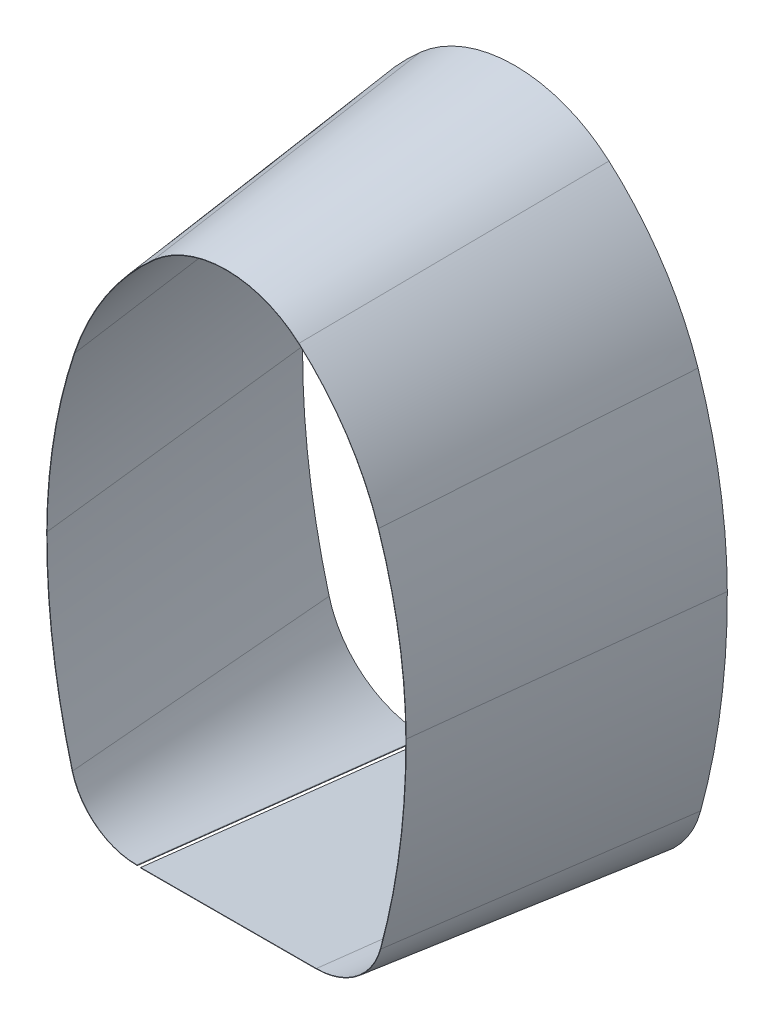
ISO-10303-21;
HEADER;
FILE_DESCRIPTION(('STEP AP214'),'2;1');
FILE_NAME('part.step','',(''),(''),'','','');
FILE_SCHEMA(('AUTOMOTIVE_DESIGN { 1 0 10303 214 1 1 1 1 }'));
ENDSEC;
DATA;
#1=APPLICATION_CONTEXT('core data for automotive mechanical design processes');
#2=APPLICATION_PROTOCOL_DEFINITION('international standard','automotive_design',2000,#1);
#3=PRODUCT_CONTEXT('',#1,'mechanical');
#4=PRODUCT('Part','Part','',(#3));
#5=PRODUCT_RELATED_PRODUCT_CATEGORY('part','',(#4));
#6=PRODUCT_DEFINITION_FORMATION('','',#4);
#7=PRODUCT_DEFINITION_CONTEXT('part definition',#1,'design');
#8=PRODUCT_DEFINITION('design','',#6,#7);
#9=PRODUCT_DEFINITION_SHAPE('','',#8);
#10=(LENGTH_UNIT() NAMED_UNIT(*) SI_UNIT(.MILLI.,.METRE.));
#11=(NAMED_UNIT(*) PLANE_ANGLE_UNIT() SI_UNIT($,.RADIAN.));
#12=(NAMED_UNIT(*) SI_UNIT($,.STERADIAN.) SOLID_ANGLE_UNIT());
#13=UNCERTAINTY_MEASURE_WITH_UNIT(LENGTH_MEASURE(1.E-05),#10,'distance_accuracy_value','');
#14=(GEOMETRIC_REPRESENTATION_CONTEXT(3) GLOBAL_UNCERTAINTY_ASSIGNED_CONTEXT((#13)) GLOBAL_UNIT_ASSIGNED_CONTEXT((#10,
#11,#12)) REPRESENTATION_CONTEXT('',''));
#15=CARTESIAN_POINT('',(0.,0.,0.));
#16=DIRECTION('',(0.,0.,1.));
#17=DIRECTION('',(1.,0.,0.));
#18=AXIS2_PLACEMENT_3D('',#15,#16,#17);
#19=CARTESIAN_POINT('',(-13.1202957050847,-42.3794226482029,-41.1240850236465));
#20=DIRECTION('',(-0.000243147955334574,0.113202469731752,0.993571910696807));
#21=DIRECTION('',(0.999997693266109,0.00214789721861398,1.25385872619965E-10));
#22=AXIS2_PLACEMENT_3D('',#19,#20,#21);
#23=PLANE('',#22);
#24=DIRECTION('',(0.00213409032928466,-0.993569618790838,0.113202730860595));
#25=VECTOR('',#24,1.);
#26=CARTESIAN_POINT('',(-13.1202957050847,-42.3794226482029,-41.1240850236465));
#27=LINE('',#26,#25);
#28=CARTESIAN_POINT('',(-13.1202957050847,-42.3794226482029,-41.1240850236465));
#29=VERTEX_POINT('',#28);
#30=CARTESIAN_POINT('',(-13.1201740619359,-42.436056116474,-41.1176324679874));
#31=VERTEX_POINT('',#30);
#32=EDGE_CURVE('E12',#29,#31,#27,.T.);
#33=ORIENTED_EDGE('',*,*,#32,.F.);
#34=DIRECTION('',(0.999997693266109,0.00214789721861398,1.25385872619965E-10));
#35=VECTOR('',#34,1.);
#36=CARTESIAN_POINT('',(-13.1202957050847,-42.3794226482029,-41.1240850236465));
#37=LINE('',#36,#35);
#38=CARTESIAN_POINT('',(13.7603710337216,-42.3216856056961,-41.124085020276));
#39=VERTEX_POINT('',#38);
#40=EDGE_CURVE('E317',#29,#39,#37,.T.);
#41=ORIENTED_EDGE('',*,*,#40,.T.);
#42=DIRECTION('',(0.00213409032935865,-0.993569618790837,0.113202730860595));
#43=VECTOR('',#42,1.);
#44=CARTESIAN_POINT('',(13.7603710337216,-42.3216856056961,-41.124085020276));
#45=LINE('',#44,#43);
#46=CARTESIAN_POINT('',(13.7604926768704,-42.3783190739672,-41.1176324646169));
#47=VERTEX_POINT('',#46);
#48=EDGE_CURVE('E96',#39,#47,#45,.T.);
#49=ORIENTED_EDGE('',*,*,#48,.T.);
#50=DIRECTION('',(0.999997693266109,0.00214789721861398,1.25385872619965E-10));
#51=VECTOR('',#50,1.);
#52=CARTESIAN_POINT('',(-13.1201740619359,-42.436056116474,-41.1176324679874));
#53=LINE('',#52,#51);
#54=EDGE_CURVE('E315',#31,#47,#53,.T.);
#55=ORIENTED_EDGE('',*,*,#54,.F.);
#56=EDGE_LOOP('',(#33,#41,#49,#55));
#57=FACE_BOUND('',#56,.T.);
#58=ADVANCED_FACE('F86',(#57),#23,.F.);
#59=CARTESIAN_POINT('',(13.7277445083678,-27.1317361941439,-41.124085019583));
#60=DIRECTION('',(-1.25287458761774E-10,-4.5891455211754E-11,1.));
#61=DIRECTION('',(1.,0.,1.25287458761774E-10));
#62=AXIS2_PLACEMENT_3D('',#59,#60,#61);
#63=CONICAL_SURFACE('',#62,15.1899844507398,1.45735041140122);
#64=ORIENTED_EDGE('',*,*,#48,.F.);
#65=CARTESIAN_POINT('',(13.7277445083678,-27.1317361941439,-41.124085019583));
#66=DIRECTION('',(-1.25287458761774E-10,-4.5891455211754E-11,1.));
#67=DIRECTION('',(1.,0.,1.25287458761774E-10));
#68=AXIS2_PLACEMENT_3D('',#65,#66,#67);
#69=CIRCLE('',#68,15.1899844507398);
#70=CARTESIAN_POINT('',(28.3914182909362,-31.0956104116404,-41.1240850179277));
#71=VERTEX_POINT('',#70);
#72=EDGE_CURVE('E441',#39,#71,#69,.T.);
#73=ORIENTED_EDGE('',*,*,#72,.T.);
#74=DIRECTION('',(0.959146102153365,-0.259275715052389,0.113202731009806));
#75=VECTOR('',#74,1.);
#76=CARTESIAN_POINT('',(28.3914182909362,-31.0956104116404,-41.1240850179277));
#77=LINE('',#76,#75);
#78=CARTESIAN_POINT('',(28.4460896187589,-31.1103891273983,-41.1176324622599));
#79=VERTEX_POINT('',#78);
#80=EDGE_CURVE('E308',#71,#79,#77,.T.);
#81=ORIENTED_EDGE('',*,*,#80,.T.);
#82=CARTESIAN_POINT('',(13.727744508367,-27.1317361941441,-41.1176324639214));
#83=DIRECTION('',(1.25287458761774E-10,4.5891455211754E-11,-1.));
#84=DIRECTION('',(-1.,0.,-1.25287458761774E-10));
#85=AXIS2_PLACEMENT_3D('',#82,#83,#84);
#86=CIRCLE('',#85,15.2466180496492);
#87=EDGE_CURVE('E322',#47,#79,#86,.F.);
#88=ORIENTED_EDGE('',*,*,#87,.F.);
#89=EDGE_LOOP('',(#64,#73,#81,#88));
#90=FACE_BOUND('',#89,.T.);
#91=ADVANCED_FACE('F323',(#90),#63,.T.);
#92=CARTESIAN_POINT('',(-84.9013158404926,-0.470396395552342,-41.1240850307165));
#93=DIRECTION('',(-1.25287458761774E-10,-4.5891455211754E-11,1.));
#94=DIRECTION('',(1.,0.,1.25287458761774E-10));
#95=AXIS2_PLACEMENT_3D('',#92,#93,#94);
#96=CONICAL_SURFACE('',#95,117.359053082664,1.45735041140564);
#97=ORIENTED_EDGE('',*,*,#80,.F.);
#98=CARTESIAN_POINT('',(-84.9013158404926,-0.470396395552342,-41.1240850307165));
#99=DIRECTION('',(-1.25287458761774E-10,-4.5891455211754E-11,1.));
#100=DIRECTION('',(1.,0.,1.25287458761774E-10));
#101=AXIS2_PLACEMENT_3D('',#98,#99,#100);
#102=CIRCLE('',#101,117.359053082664);
#103=CARTESIAN_POINT('',(32.4568866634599,-0.0235793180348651,-41.1240850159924));
#104=VERTEX_POINT('',#103);
#105=EDGE_CURVE('E449',#71,#104,#102,.T.);
#106=ORIENTED_EDGE('',*,*,#105,.T.);
#107=DIRECTION('',(0.993564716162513,0.00378106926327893,0.113202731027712));
#108=VECTOR('',#107,1.);
#109=CARTESIAN_POINT('',(32.4568866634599,-0.0235793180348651,-41.1240850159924));
#110=LINE('',#109,#108);
#111=CARTESIAN_POINT('',(32.5135198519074,-0.0233636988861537,-41.1176324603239));
#112=VERTEX_POINT('',#111);
#113=EDGE_CURVE('E306',#104,#112,#110,.T.);
#114=ORIENTED_EDGE('',*,*,#113,.T.);
#115=CARTESIAN_POINT('',(-84.9013158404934,-0.470396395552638,-41.1176324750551));
#116=DIRECTION('',(1.25287458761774E-10,4.5891455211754E-11,-1.));
#117=DIRECTION('',(-1.,0.,-1.25287458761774E-10));
#118=AXIS2_PLACEMENT_3D('',#115,#116,#117);
#119=CIRCLE('',#118,117.415686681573);
#120=EDGE_CURVE('E352',#79,#112,#119,.F.);
#121=ORIENTED_EDGE('',*,*,#120,.F.);
#122=EDGE_LOOP('',(#97,#106,#114,#121));
#123=FACE_BOUND('',#122,.T.);
#124=ADVANCED_FACE('F567',(#123),#96,.T.);
#125=CARTESIAN_POINT('',(-55.3216154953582,-0.357625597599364,-41.1240850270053));
#126=DIRECTION('',(-1.25287458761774E-10,-4.5891455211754E-11,1.));
#127=DIRECTION('',(1.,0.,1.25287458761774E-10));
#128=AXIS2_PLACEMENT_3D('',#125,#126,#127);
#129=CONICAL_SURFACE('',#128,87.7791377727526,1.45735041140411);
#130=ORIENTED_EDGE('',*,*,#113,.F.);
#131=CARTESIAN_POINT('',(-55.3216154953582,-0.357625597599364,-41.1240850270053));
#132=DIRECTION('',(-1.25287458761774E-10,-4.5891455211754E-11,1.));
#133=DIRECTION('',(1.,0.,1.25287458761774E-10));
#134=AXIS2_PLACEMENT_3D('',#131,#132,#133);
#135=CIRCLE('',#134,87.7791377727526);
#136=CARTESIAN_POINT('',(27.9821235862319,27.3130101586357,-41.1240850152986));
#137=VERTEX_POINT('',#136);
#138=EDGE_CURVE('E458',#104,#137,#135,.T.);
#139=ORIENTED_EDGE('',*,*,#138,.T.);
#140=DIRECTION('',(0.94291488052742,0.313203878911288,0.113202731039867));
#141=VECTOR('',#140,1.);
#142=CARTESIAN_POINT('',(27.9821235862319,27.3130101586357,-41.1240850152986));
#143=LINE('',#142,#141);
#144=CARTESIAN_POINT('',(28.035869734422,27.3308627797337,-41.1176324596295));
#145=VERTEX_POINT('',#144);
#146=EDGE_CURVE('E304',#137,#145,#143,.T.);
#147=ORIENTED_EDGE('',*,*,#146,.T.);
#148=CARTESIAN_POINT('',(-55.321615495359,-0.35762559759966,-41.1176324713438));
#149=DIRECTION('',(1.25287458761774E-10,4.5891455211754E-11,-1.));
#150=DIRECTION('',(-1.,0.,-1.25287458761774E-10));
#151=AXIS2_PLACEMENT_3D('',#148,#149,#150);
#152=CIRCLE('',#151,87.835771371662);
#153=EDGE_CURVE('E357',#112,#145,#152,.F.);
#154=ORIENTED_EDGE('',*,*,#153,.F.);
#155=EDGE_LOOP('',(#130,#139,#147,#154));
#156=FACE_BOUND('',#155,.T.);
#157=ADVANCED_FACE('F560',(#156),#129,.T.);
#158=CARTESIAN_POINT('',(-17.0570731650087,12.3525387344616,-41.124085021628));
#159=DIRECTION('',(-1.25287458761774E-10,-4.5891455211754E-11,1.));
#160=DIRECTION('',(1.,0.,1.25287458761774E-10));
#161=AXIS2_PLACEMENT_3D('',#158,#159,#160);
#162=CONICAL_SURFACE('',#161,47.4588764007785,1.45735041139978);
#163=ORIENTED_EDGE('',*,*,#146,.F.);
#164=CARTESIAN_POINT('',(-17.0570731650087,12.3525387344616,-41.124085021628));
#165=DIRECTION('',(-1.25287458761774E-10,-4.5891455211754E-11,1.));
#166=DIRECTION('',(1.,0.,1.25287458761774E-10));
#167=AXIS2_PLACEMENT_3D('',#164,#165,#166);
#168=CIRCLE('',#167,47.4588764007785);
#169=CARTESIAN_POINT('',(14.3800135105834,47.9060832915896,-41.1240850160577));
#170=VERTEX_POINT('',#169);
#171=EDGE_CURVE('E467',#137,#170,#168,.T.);
#172=ORIENTED_EDGE('',*,*,#171,.T.);
#173=DIRECTION('',(0.658148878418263,0.744328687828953,0.113202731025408));
#174=VECTOR('',#173,1.);
#175=CARTESIAN_POINT('',(14.3800135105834,47.9060832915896,-41.1240850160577));
#176=LINE('',#175,#174);
#177=CARTESIAN_POINT('',(14.4175279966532,47.9485100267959,-41.1176324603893));
#178=VERTEX_POINT('',#177);
#179=EDGE_CURVE('E302',#170,#178,#176,.T.);
#180=ORIENTED_EDGE('',*,*,#179,.T.);
#181=CARTESIAN_POINT('',(-17.0570731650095,12.3525387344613,-41.1176324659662));
#182=DIRECTION('',(1.25287458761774E-10,4.5891455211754E-11,-1.));
#183=DIRECTION('',(-1.,0.,-1.25287458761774E-10));
#184=AXIS2_PLACEMENT_3D('',#181,#182,#183);
#185=CIRCLE('',#184,47.5155099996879);
#186=EDGE_CURVE('E362',#145,#178,#185,.F.);
#187=ORIENTED_EDGE('',*,*,#186,.F.);
#188=EDGE_LOOP('',(#163,#172,#180,#187));
#189=FACE_BOUND('',#188,.T.);
#190=ADVANCED_FACE('F553',(#189),#162,.T.);
#191=CARTESIAN_POINT('',(5.15233384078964E-09,31.6431115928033,-41.1240850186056));
#192=DIRECTION('',(-1.25287458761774E-10,-4.5891455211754E-11,1.));
#193=DIRECTION('',(1.,0.,1.25287458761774E-10));
#194=AXIS2_PLACEMENT_3D('',#191,#192,#193);
#195=CONICAL_SURFACE('',#194,21.7087318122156,1.45735041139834);
#196=ORIENTED_EDGE('',*,*,#179,.F.);
#197=CARTESIAN_POINT('',(5.15233384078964E-09,31.6431115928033,-41.1240850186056));
#198=DIRECTION('',(-1.25287458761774E-10,-4.5891455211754E-11,1.));
#199=DIRECTION('',(1.,0.,1.25287458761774E-10));
#200=AXIS2_PLACEMENT_3D('',#197,#198,#199);
#201=CIRCLE('',#200,21.7087318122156);
#202=CARTESIAN_POINT('',(-14.3800135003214,47.9060832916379,-41.124085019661));
#203=VERTEX_POINT('',#202);
#204=EDGE_CURVE('E476',#170,#203,#201,.T.);
#205=ORIENTED_EDGE('',*,*,#204,.T.);
#206=DIRECTION('',(-0.658148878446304,0.744328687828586,0.113202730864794));
#207=VECTOR('',#206,1.);
#208=CARTESIAN_POINT('',(-14.3800135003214,47.9060832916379,-41.124085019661));
#209=LINE('',#208,#207);
#210=CARTESIAN_POINT('',(-14.4175279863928,47.9485100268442,-41.1176324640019));
#211=VERTEX_POINT('',#210);
#212=EDGE_CURVE('E300',#203,#211,#209,.T.);
#213=ORIENTED_EDGE('',*,*,#212,.T.);
#214=CARTESIAN_POINT('',(5.15152541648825E-09,31.643111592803,-41.1176324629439));
#215=DIRECTION('',(1.25287458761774E-10,4.5891455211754E-11,-1.));
#216=DIRECTION('',(-1.,0.,-1.25287458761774E-10));
#217=AXIS2_PLACEMENT_3D('',#214,#215,#216);
#218=CIRCLE('',#217,21.765365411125);
#219=EDGE_CURVE('E367',#178,#211,#218,.F.);
#220=ORIENTED_EDGE('',*,*,#219,.F.);
#221=EDGE_LOOP('',(#196,#205,#213,#220));
#222=FACE_BOUND('',#221,.T.);
#223=ADVANCED_FACE('F546',(#222),#195,.T.);
#224=CARTESIAN_POINT('',(17.0570731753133,12.3525387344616,-41.1240850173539));
#225=DIRECTION('',(-1.25287458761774E-10,-4.5891455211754E-11,1.));
#226=DIRECTION('',(1.,0.,1.25287458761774E-10));
#227=AXIS2_PLACEMENT_3D('',#224,#225,#226);
#228=CONICAL_SURFACE('',#227,47.4588764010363,1.45735041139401);
#229=ORIENTED_EDGE('',*,*,#212,.F.);
#230=CARTESIAN_POINT('',(17.0570731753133,12.3525387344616,-41.1240850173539));
#231=DIRECTION('',(-1.25287458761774E-10,-4.5891455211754E-11,1.));
#232=DIRECTION('',(1.,0.,1.25287458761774E-10));
#233=AXIS2_PLACEMENT_3D('',#230,#231,#232);
#234=CIRCLE('',#233,47.4588764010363);
#235=CARTESIAN_POINT('',(-27.9821235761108,27.3130101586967,-41.1240850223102));
#236=VERTEX_POINT('',#235);
#237=EDGE_CURVE('E485',#203,#236,#234,.T.);
#238=ORIENTED_EDGE('',*,*,#237,.T.);
#239=DIRECTION('',(-0.94291488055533,0.313203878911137,0.113202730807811));
#240=VECTOR('',#239,1.);
#241=CARTESIAN_POINT('',(-27.9821235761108,27.3130101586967,-41.1240850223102));
#242=LINE('',#241,#240);
#243=CARTESIAN_POINT('',(-28.0358697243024,27.3308627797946,-41.117632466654));
#244=VERTEX_POINT('',#243);
#245=EDGE_CURVE('E298',#236,#244,#242,.T.);
#246=ORIENTED_EDGE('',*,*,#245,.T.);
#247=CARTESIAN_POINT('',(17.0570731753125,12.3525387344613,-41.1176324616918));
#248=DIRECTION('',(1.25287458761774E-10,4.5891455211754E-11,-1.));
#249=DIRECTION('',(-1.,0.,-1.25287458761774E-10));
#250=AXIS2_PLACEMENT_3D('',#247,#248,#249);
#251=CIRCLE('',#250,47.5155099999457);
#252=EDGE_CURVE('E372',#211,#244,#251,.F.);
#253=ORIENTED_EDGE('',*,*,#252,.F.);
#254=EDGE_LOOP('',(#229,#238,#246,#253));
#255=FACE_BOUND('',#254,.T.);
#256=ADVANCED_FACE('F539',(#255),#228,.T.);
#257=CARTESIAN_POINT('',(55.3216155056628,-0.357625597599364,-41.1240850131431));
#258=DIRECTION('',(-1.25287458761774E-10,-4.5891455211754E-11,1.));
#259=DIRECTION('',(1.,0.,1.25287458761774E-10));
#260=AXIS2_PLACEMENT_3D('',#257,#258,#259);
#261=CONICAL_SURFACE('',#260,87.7791377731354,1.45735041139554);
#262=ORIENTED_EDGE('',*,*,#245,.F.);
#263=CARTESIAN_POINT('',(55.3216155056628,-0.357625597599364,-41.1240850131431));
#264=DIRECTION('',(-1.25287458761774E-10,-4.5891455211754E-11,1.));
#265=DIRECTION('',(1.,0.,1.25287458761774E-10));
#266=AXIS2_PLACEMENT_3D('',#263,#264,#265);
#267=CIRCLE('',#266,87.7791377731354);
#268=CARTESIAN_POINT('',(-32.4568866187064,-0.0235702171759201,-41.1240850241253));
#269=VERTEX_POINT('',#268);
#270=EDGE_CURVE('E494',#236,#269,#267,.T.);
#271=ORIENTED_EDGE('',*,*,#270,.T.);
#272=DIRECTION('',(-0.993564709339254,0.00378286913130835,0.11320273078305));
#273=VECTOR('',#272,1.);
#274=CARTESIAN_POINT('',(-32.4568866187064,-0.0235702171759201,-41.1240850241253));
#275=LINE('',#274,#273);
#276=CARTESIAN_POINT('',(-32.5135198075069,-0.0233546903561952,-41.1176324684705));
#277=VERTEX_POINT('',#276);
#278=EDGE_CURVE('E296',#269,#277,#275,.T.);
#279=ORIENTED_EDGE('',*,*,#278,.T.);
#280=CARTESIAN_POINT('',(55.321615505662,-0.35762559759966,-41.1176324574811));
#281=DIRECTION('',(1.25287458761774E-10,4.5891455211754E-11,-1.));
#282=DIRECTION('',(-1.,0.,-1.25287458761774E-10));
#283=AXIS2_PLACEMENT_3D('',#280,#281,#282);
#284=CIRCLE('',#283,87.8357713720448);
#285=EDGE_CURVE('E377',#244,#277,#284,.F.);
#286=ORIENTED_EDGE('',*,*,#285,.F.);
#287=EDGE_LOOP('',(#262,#271,#279,#286));
#288=FACE_BOUND('',#287,.T.);
#289=ADVANCED_FACE('F532',(#288),#261,.T.);
#290=CARTESIAN_POINT('',(84.9013158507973,-0.470396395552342,-41.1240850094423));
#291=DIRECTION('',(-1.25287458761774E-10,-4.5891455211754E-11,1.));
#292=DIRECTION('',(1.,0.,1.25287458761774E-10));
#293=AXIS2_PLACEMENT_3D('',#290,#291,#292);
#294=CONICAL_SURFACE('',#293,117.359053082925,1.45735041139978);
#295=ORIENTED_EDGE('',*,*,#278,.F.);
#296=CARTESIAN_POINT('',(84.9013158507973,-0.470396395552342,-41.1240850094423));
#297=DIRECTION('',(-1.25287458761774E-10,-4.5891455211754E-11,1.));
#298=DIRECTION('',(1.,0.,1.25287458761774E-10));
#299=AXIS2_PLACEMENT_3D('',#296,#297,#298);
#300=CIRCLE('',#299,117.359053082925);
#301=CARTESIAN_POINT('',(-28.3914182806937,-31.0956104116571,-41.1240850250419));
#302=VERTEX_POINT('',#301);
#303=EDGE_CURVE('E503',#269,#302,#300,.T.);
#304=ORIENTED_EDGE('',*,*,#303,.T.);
#305=DIRECTION('',(-0.959146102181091,-0.259275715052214,0.11320273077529));
#306=VECTOR('',#305,1.);
#307=CARTESIAN_POINT('',(-28.3914182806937,-31.0956104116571,-41.1240850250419));
#308=LINE('',#307,#306);
#309=CARTESIAN_POINT('',(-28.446089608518,-31.1103891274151,-41.1176324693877));
#310=VERTEX_POINT('',#309);
#311=EDGE_CURVE('E294',#302,#310,#308,.T.);
#312=ORIENTED_EDGE('',*,*,#311,.T.);
#313=CARTESIAN_POINT('',(84.9013158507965,-0.470396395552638,-41.1176324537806));
#314=DIRECTION('',(1.25287458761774E-10,4.5891455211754E-11,-1.));
#315=DIRECTION('',(-1.,0.,-1.25287458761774E-10));
#316=AXIS2_PLACEMENT_3D('',#313,#314,#315);
#317=CIRCLE('',#316,117.415686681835);
#318=EDGE_CURVE('E382',#277,#310,#317,.F.);
#319=ORIENTED_EDGE('',*,*,#318,.F.);
#320=EDGE_LOOP('',(#295,#304,#312,#319));
#321=FACE_BOUND('',#320,.T.);
#322=ADVANCED_FACE('F525',(#321),#294,.T.);
#323=CARTESIAN_POINT('',(-13.7277444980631,-27.1317361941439,-41.1240850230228));
#324=DIRECTION('',(-1.25287458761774E-10,-4.5891455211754E-11,1.));
#325=DIRECTION('',(1.,0.,1.25287458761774E-10));
#326=AXIS2_PLACEMENT_3D('',#323,#324,#325);
#327=CONICAL_SURFACE('',#326,15.1899844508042,1.45735041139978);
#328=ORIENTED_EDGE('',*,*,#311,.F.);
#329=CARTESIAN_POINT('',(-13.7277444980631,-27.1317361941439,-41.1240850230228));
#330=DIRECTION('',(-1.25287458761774E-10,-4.5891455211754E-11,1.));
#331=DIRECTION('',(1.,0.,1.25287458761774E-10));
#332=AXIS2_PLACEMENT_3D('',#329,#330,#331);
#333=CIRCLE('',#332,15.1899844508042);
#334=CARTESIAN_POINT('',(-13.7277444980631,-42.3217206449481,-41.1240850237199));
#335=VERTEX_POINT('',#334);
#336=EDGE_CURVE('E510',#302,#335,#333,.T.);
#337=ORIENTED_EDGE('',*,*,#336,.T.);
#338=DIRECTION('',(-1.41827248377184E-11,-0.993571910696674,0.113202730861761));
#339=VECTOR('',#338,1.);
#340=CARTESIAN_POINT('',(-13.7277444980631,-42.3217206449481,-41.1240850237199));
#341=LINE('',#340,#339);
#342=CARTESIAN_POINT('',(-13.7277444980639,-42.3783542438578,-41.1176324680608));
#343=VERTEX_POINT('',#342);
#344=EDGE_CURVE('E292',#335,#343,#341,.T.);
#345=ORIENTED_EDGE('',*,*,#344,.T.);
#346=CARTESIAN_POINT('',(-13.727744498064,-27.1317361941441,-41.1176324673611));
#347=DIRECTION('',(1.25287458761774E-10,4.5891455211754E-11,-1.));
#348=DIRECTION('',(-1.,0.,-1.25287458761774E-10));
#349=AXIS2_PLACEMENT_3D('',#346,#347,#348);
#350=CIRCLE('',#349,15.2466180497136);
#351=EDGE_CURVE('E386',#310,#343,#350,.F.);
#352=ORIENTED_EDGE('',*,*,#351,.F.);
#353=EDGE_LOOP('',(#328,#337,#345,#352));
#354=FACE_BOUND('',#353,.T.);
#355=ADVANCED_FACE('F518',(#354),#327,.T.);
#356=CARTESIAN_POINT('',(-13.7277444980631,-42.3217206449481,-41.1240850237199));
#357=DIRECTION('',(-1.24510878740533E-10,0.113202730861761,0.993571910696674));
#358=DIRECTION('',(1.,0.,1.25316423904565E-10));
#359=AXIS2_PLACEMENT_3D('',#356,#357,#358);
#360=PLANE('',#359);
#361=ORIENTED_EDGE('',*,*,#344,.F.);
#362=DIRECTION('',(1.,0.,1.25316423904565E-10));
#363=VECTOR('',#362,1.);
#364=CARTESIAN_POINT('',(-13.7277444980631,-42.3217206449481,-41.1240850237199));
#365=LINE('',#364,#363);
#366=CARTESIAN_POINT('',(-13.6277444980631,-42.3217206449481,-41.1240850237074));
#367=VERTEX_POINT('',#366);
#368=EDGE_CURVE('E267',#335,#367,#365,.T.);
#369=ORIENTED_EDGE('',*,*,#368,.T.);
#370=DIRECTION('',(-1.41827248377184E-11,-0.993571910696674,0.113202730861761));
#371=VECTOR('',#370,1.);
#372=CARTESIAN_POINT('',(-13.6277444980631,-42.3217206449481,-41.1240850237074));
#373=LINE('',#372,#371);
#374=CARTESIAN_POINT('',(-13.627744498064,-42.3783542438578,-41.1176324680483));
#375=VERTEX_POINT('',#374);
#376=EDGE_CURVE('E243',#367,#375,#373,.T.);
#377=ORIENTED_EDGE('',*,*,#376,.T.);
#378=DIRECTION('',(1.,0.,1.25316423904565E-10));
#379=VECTOR('',#378,1.);
#380=CARTESIAN_POINT('',(-13.7277444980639,-42.3783542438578,-41.1176324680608));
#381=LINE('',#380,#379);
#382=EDGE_CURVE('E387',#343,#375,#381,.T.);
#383=ORIENTED_EDGE('',*,*,#382,.F.);
#384=EDGE_LOOP('',(#361,#369,#377,#383));
#385=FACE_BOUND('',#384,.T.);
#386=ADVANCED_FACE('F514',(#385),#360,.F.);
#387=CARTESIAN_POINT('',(-13.6277444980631,-42.3217206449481,-41.1240850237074));
#388=DIRECTION('',(-1.,0.,-1.25287447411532E-10));
#389=DIRECTION('',(-1.24482106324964E-10,0.113202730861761,0.993571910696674));
#390=AXIS2_PLACEMENT_3D('',#387,#388,#389);
#391=PLANE('',#390);
#392=ORIENTED_EDGE('',*,*,#376,.F.);
#393=DIRECTION('',(-1.24482106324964E-10,0.113202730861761,0.993571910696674));
#394=VECTOR('',#393,1.);
#395=CARTESIAN_POINT('',(-13.6277444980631,-42.3217206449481,-41.1240850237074));
#396=LINE('',#395,#394);
#397=CARTESIAN_POINT('',(-13.6277445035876,-37.2978206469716,2.97030989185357));
#398=VERTEX_POINT('',#397);
#399=EDGE_CURVE('E262',#367,#398,#396,.T.);
#400=ORIENTED_EDGE('',*,*,#399,.T.);
#401=DIRECTION('',(-1.41827248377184E-11,-0.993571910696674,0.113202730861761));
#402=VECTOR('',#401,1.);
#403=CARTESIAN_POINT('',(-13.6277445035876,-37.2978206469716,2.97030989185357));
#404=LINE('',#403,#402);
#405=CARTESIAN_POINT('',(-13.6277445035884,-37.3544542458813,2.97676244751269));
#406=VERTEX_POINT('',#405);
#407=EDGE_CURVE('E249',#398,#406,#404,.T.);
#408=ORIENTED_EDGE('',*,*,#407,.T.);
#409=DIRECTION('',(-1.24482106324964E-10,0.113202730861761,0.993571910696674));
#410=VECTOR('',#409,1.);
#411=CARTESIAN_POINT('',(-13.627744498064,-42.3783542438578,-41.1176324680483));
#412=LINE('',#411,#410);
#413=EDGE_CURVE('E406',#375,#406,#412,.T.);
#414=ORIENTED_EDGE('',*,*,#413,.F.);
#415=EDGE_LOOP('',(#392,#400,#408,#414));
#416=FACE_BOUND('',#415,.T.);
#417=ADVANCED_FACE('F269',(#416),#391,.F.);
#418=CARTESIAN_POINT('',(-13.7277445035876,-37.2978206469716,2.97030989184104));
#419=DIRECTION('',(-1.24480716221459E-10,0.113202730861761,0.993571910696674));
#420=DIRECTION('',(1.,0.,1.25286066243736E-10));
#421=AXIS2_PLACEMENT_3D('',#418,#419,#420);
#422=PLANE('',#421);
#423=ORIENTED_EDGE('',*,*,#407,.F.);
#424=DIRECTION('',(1.,0.,1.25286066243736E-10));
#425=VECTOR('',#424,1.);
#426=CARTESIAN_POINT('',(-13.7277445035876,-37.2978206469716,2.97030989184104));
#427=LINE('',#426,#425);
#428=CARTESIAN_POINT('',(-13.7277445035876,-37.2978206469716,2.97030989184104));
#429=VERTEX_POINT('',#428);
#430=EDGE_CURVE('E252',#429,#398,#427,.T.);
#431=ORIENTED_EDGE('',*,*,#430,.F.);
#432=DIRECTION('',(-1.41822326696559E-11,-0.993571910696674,0.113202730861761));
#433=VECTOR('',#432,1.);
#434=CARTESIAN_POINT('',(-13.7277445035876,-37.2978206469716,2.97030989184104));
#435=LINE('',#434,#433);
#436=CARTESIAN_POINT('',(-13.7277445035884,-37.3544542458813,2.97676244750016));
#437=VERTEX_POINT('',#436);
#438=EDGE_CURVE('E256',#429,#437,#435,.T.);
#439=ORIENTED_EDGE('',*,*,#438,.T.);
#440=DIRECTION('',(1.,0.,1.25286066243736E-10));
#441=VECTOR('',#440,1.);
#442=CARTESIAN_POINT('',(-13.7277445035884,-37.3544542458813,2.97676244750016));
#443=LINE('',#442,#441);
#444=EDGE_CURVE('E254',#437,#406,#443,.T.);
#445=ORIENTED_EDGE('',*,*,#444,.T.);
#446=EDGE_LOOP('',(#423,#431,#439,#445));
#447=FACE_BOUND('',#446,.T.);
#448=ADVANCED_FACE('F251',(#447),#422,.T.);
#449=CARTESIAN_POINT('',(-13.7277445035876,-27.1317361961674,2.97030989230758));
#450=DIRECTION('',(-1.25287458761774E-10,-4.5891455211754E-11,1.));
#451=DIRECTION('',(1.,0.,1.25287458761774E-10));
#452=AXIS2_PLACEMENT_3D('',#449,#450,#451);
#453=CONICAL_SURFACE('',#452,10.1660844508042,1.45735041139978);
#454=ORIENTED_EDGE('',*,*,#438,.F.);
#455=CARTESIAN_POINT('',(-13.7277445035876,-27.1317361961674,2.97030989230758));
#456=DIRECTION('',(-1.25287458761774E-10,-4.5891455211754E-11,1.));
#457=DIRECTION('',(1.,0.,1.25287458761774E-10));
#458=AXIS2_PLACEMENT_3D('',#455,#456,#457);
#459=CIRCLE('',#458,10.1660844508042);
#460=CARTESIAN_POINT('',(-23.541589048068,-29.7846079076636,2.97030989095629));
#461=VERTEX_POINT('',#460);
#462=EDGE_CURVE('E504',#461,#429,#459,.T.);
#463=ORIENTED_EDGE('',*,*,#462,.F.);
#464=DIRECTION('',(-0.959146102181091,-0.259275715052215,0.11320273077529));
#465=VECTOR('',#464,1.);
#466=CARTESIAN_POINT('',(-23.541589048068,-29.7846079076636,2.97030989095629));
#467=LINE('',#466,#465);
#468=CARTESIAN_POINT('',(-23.5962603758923,-29.7993866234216,2.97676244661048));
#469=VERTEX_POINT('',#468);
#470=EDGE_CURVE('E288',#461,#469,#467,.T.);
#471=ORIENTED_EDGE('',*,*,#470,.T.);
#472=CARTESIAN_POINT('',(-13.7277445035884,-27.1317361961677,2.9767624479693));
#473=DIRECTION('',(1.25287458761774E-10,4.5891455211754E-11,-1.));
#474=DIRECTION('',(-1.,0.,-1.25287458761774E-10));
#475=AXIS2_PLACEMENT_3D('',#472,#473,#474);
#476=CIRCLE('',#475,10.2227180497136);
#477=EDGE_CURVE('E383',#469,#437,#476,.F.);
#478=ORIENTED_EDGE('',*,*,#477,.T.);
#479=EDGE_LOOP('',(#454,#463,#471,#478));
#480=FACE_BOUND('',#479,.T.);
#481=ADVANCED_FACE('F604',(#480),#453,.F.);
#482=CARTESIAN_POINT('',(84.9013158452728,-0.470396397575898,2.9703099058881));
#483=DIRECTION('',(-1.25287458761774E-10,-4.5891455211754E-11,1.));
#484=DIRECTION('',(1.,0.,1.25287458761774E-10));
#485=AXIS2_PLACEMENT_3D('',#482,#483,#484);
#486=CONICAL_SURFACE('',#485,112.335153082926,1.45735041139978);
#487=ORIENTED_EDGE('',*,*,#470,.F.);
#488=CARTESIAN_POINT('',(84.9013158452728,-0.470396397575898,2.9703099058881));
#489=DIRECTION('',(-1.25287458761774E-10,-4.5891455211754E-11,1.));
#490=DIRECTION('',(1.,0.,1.25287458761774E-10));
#491=AXIS2_PLACEMENT_3D('',#488,#489,#490);
#492=CIRCLE('',#491,112.335153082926);
#493=CARTESIAN_POINT('',(-27.4330230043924,-0.0426893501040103,2.97030989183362));
#494=VERTEX_POINT('',#493);
#495=EDGE_CURVE('E495',#494,#461,#492,.T.);
#496=ORIENTED_EDGE('',*,*,#495,.F.);
#497=DIRECTION('',(-0.993564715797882,0.00378117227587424,0.113202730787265));
#498=VECTOR('',#497,1.);
#499=CARTESIAN_POINT('',(-27.4330230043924,-0.0426893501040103,2.97030989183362));
#500=LINE('',#499,#498);
#501=CARTESIAN_POINT('',(-27.4896561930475,-0.0424737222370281,2.97676244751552));
#502=VERTEX_POINT('',#501);
#503=EDGE_CURVE('E286',#494,#502,#500,.T.);
#504=ORIENTED_EDGE('',*,*,#503,.T.);
#505=CARTESIAN_POINT('',(84.901315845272,-0.470396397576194,2.9767624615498));
#506=DIRECTION('',(1.25287458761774E-10,4.5891455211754E-11,-1.));
#507=DIRECTION('',(-1.,0.,-1.25287458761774E-10));
#508=AXIS2_PLACEMENT_3D('',#505,#506,#507);
#509=CIRCLE('',#508,112.391786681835);
#510=EDGE_CURVE('E378',#502,#469,#509,.F.);
#511=ORIENTED_EDGE('',*,*,#510,.T.);
#512=EDGE_LOOP('',(#487,#496,#504,#511));
#513=FACE_BOUND('',#512,.T.);
#514=ADVANCED_FACE('F600',(#513),#486,.F.);
#515=CARTESIAN_POINT('',(55.3216155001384,-0.35762559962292,2.97030990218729));
#516=DIRECTION('',(-1.25287458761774E-10,-4.5891455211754E-11,1.));
#517=DIRECTION('',(1.,0.,1.25287458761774E-10));
#518=AXIS2_PLACEMENT_3D('',#515,#516,#517);
#519=CONICAL_SURFACE('',#518,82.7552377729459,1.45735041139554);
#520=ORIENTED_EDGE('',*,*,#503,.F.);
#521=CARTESIAN_POINT('',(55.3216155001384,-0.35762559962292,2.97030990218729));
#522=DIRECTION('',(-1.25287458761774E-10,-4.5891455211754E-11,1.));
#523=DIRECTION('',(1.,0.,1.25287458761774E-10));
#524=AXIS2_PLACEMENT_3D('',#521,#522,#523);
#525=CIRCLE('',#524,82.7552377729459);
#526=CARTESIAN_POINT('',(-23.2143659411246,25.7293251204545,2.97030989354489));
#527=VERTEX_POINT('',#526);
#528=EDGE_CURVE('E486',#527,#494,#525,.T.);
#529=ORIENTED_EDGE('',*,*,#528,.F.);
#530=DIRECTION('',(-0.942914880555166,0.313203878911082,0.113202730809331));
#531=VECTOR('',#530,1.);
#532=CARTESIAN_POINT('',(-23.2143659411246,25.7293251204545,2.97030989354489));
#533=LINE('',#532,#531);
#534=CARTESIAN_POINT('',(-23.2681120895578,25.7471777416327,2.97676244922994));
#535=VERTEX_POINT('',#534);
#536=EDGE_CURVE('E284',#527,#535,#533,.T.);
#537=ORIENTED_EDGE('',*,*,#536,.T.);
#538=CARTESIAN_POINT('',(55.3216155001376,-0.357625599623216,2.97676245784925));
#539=DIRECTION('',(1.25287458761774E-10,4.5891455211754E-11,-1.));
#540=DIRECTION('',(-1.,0.,-1.25287458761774E-10));
#541=AXIS2_PLACEMENT_3D('',#538,#539,#540);
#542=CIRCLE('',#541,82.8118713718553);
#543=EDGE_CURVE('E373',#535,#502,#542,.F.);
#544=ORIENTED_EDGE('',*,*,#543,.T.);
#545=EDGE_LOOP('',(#520,#529,#537,#544));
#546=FACE_BOUND('',#545,.T.);
#547=ADVANCED_FACE('F596',(#546),#519,.F.);
#548=CARTESIAN_POINT('',(17.0570731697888,12.3525387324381,2.97030989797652));
#549=DIRECTION('',(-1.25287458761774E-10,-4.5891455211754E-11,1.));
#550=DIRECTION('',(1.,0.,1.25287458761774E-10));
#551=AXIS2_PLACEMENT_3D('',#548,#549,#550);
#552=CONICAL_SURFACE('',#551,42.4349764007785,1.45735041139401);
#553=ORIENTED_EDGE('',*,*,#536,.F.);
#554=CARTESIAN_POINT('',(17.0570731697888,12.3525387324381,2.97030989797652));
#555=DIRECTION('',(-1.25287458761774E-10,-4.5891455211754E-11,1.));
#556=DIRECTION('',(1.,0.,1.25287458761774E-10));
#557=AXIS2_PLACEMENT_3D('',#554,#555,#556);
#558=CIRCLE('',#557,42.4349764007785);
#559=CARTESIAN_POINT('',(-11.0521475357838,44.1424574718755,2.97030989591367));
#560=VERTEX_POINT('',#559);
#561=EDGE_CURVE('E477',#560,#527,#558,.T.);
#562=ORIENTED_EDGE('',*,*,#561,.F.);
#563=DIRECTION('',(-0.658148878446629,0.744328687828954,0.113202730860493));
#564=VECTOR('',#563,1.);
#565=CARTESIAN_POINT('',(-11.0521475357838,44.1424574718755,2.97030989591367));
#566=LINE('',#565,#564);
#567=CARTESIAN_POINT('',(-11.0896620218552,44.1848842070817,2.97676245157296));
#568=VERTEX_POINT('',#567);
#569=EDGE_CURVE('E282',#560,#568,#566,.T.);
#570=ORIENTED_EDGE('',*,*,#569,.T.);
#571=CARTESIAN_POINT('',(17.057073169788,12.3525387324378,2.97676245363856));
#572=DIRECTION('',(1.25287458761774E-10,4.5891455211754E-11,-1.));
#573=DIRECTION('',(-1.,0.,-1.25287458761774E-10));
#574=AXIS2_PLACEMENT_3D('',#571,#572,#573);
#575=CIRCLE('',#574,42.4916099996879);
#576=EDGE_CURVE('E368',#568,#535,#575,.F.);
#577=ORIENTED_EDGE('',*,*,#576,.T.);
#578=EDGE_LOOP('',(#553,#562,#570,#577));
#579=FACE_BOUND('',#578,.T.);
#580=ADVANCED_FACE('F592',(#579),#552,.F.);
#581=CARTESIAN_POINT('',(-3.72140843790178E-10,31.6431115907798,2.97030989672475));
#582=DIRECTION('',(-1.25287458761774E-10,-4.5891455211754E-11,1.));
#583=DIRECTION('',(1.,0.,1.25287458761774E-10));
#584=AXIS2_PLACEMENT_3D('',#581,#582,#583);
#585=CONICAL_SURFACE('',#584,16.6848318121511,1.45735041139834);
#586=ORIENTED_EDGE('',*,*,#569,.F.);
#587=CARTESIAN_POINT('',(-3.72140843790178E-10,31.6431115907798,2.97030989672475));
#588=DIRECTION('',(-1.25287458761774E-10,-4.5891455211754E-11,1.));
#589=DIRECTION('',(1.,0.,1.25287458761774E-10));
#590=AXIS2_PLACEMENT_3D('',#587,#588,#589);
#591=CIRCLE('',#590,16.6848318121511);
#592=CARTESIAN_POINT('',(11.0521475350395,44.1424574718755,2.97030989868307));
#593=VERTEX_POINT('',#592);
#594=EDGE_CURVE('E468',#593,#560,#591,.T.);
#595=ORIENTED_EDGE('',*,*,#594,.F.);
#596=DIRECTION('',(0.658148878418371,0.744328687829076,0.113202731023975));
#597=VECTOR('',#596,1.);
#598=CARTESIAN_POINT('',(11.0521475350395,44.1424574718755,2.97030989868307));
#599=LINE('',#598,#597);
#600=CARTESIAN_POINT('',(11.0896620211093,44.1848842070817,2.97676245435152));
#601=VERTEX_POINT('',#600);
#602=EDGE_CURVE('E280',#593,#601,#599,.T.);
#603=ORIENTED_EDGE('',*,*,#602,.T.);
#604=CARTESIAN_POINT('',(-3.72949268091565E-10,31.6431115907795,2.97676245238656));
#605=DIRECTION('',(1.25287458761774E-10,4.5891455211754E-11,-1.));
#606=DIRECTION('',(-1.,0.,-1.25287458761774E-10));
#607=AXIS2_PLACEMENT_3D('',#604,#605,#606);
#608=CIRCLE('',#607,16.7414654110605);
#609=EDGE_CURVE('E363',#601,#568,#608,.F.);
#610=ORIENTED_EDGE('',*,*,#609,.T.);
#611=EDGE_LOOP('',(#586,#595,#603,#610));
#612=FACE_BOUND('',#611,.T.);
#613=ADVANCED_FACE('F588',(#612),#585,.F.);
#614=CARTESIAN_POINT('',(-17.0570731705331,12.3525387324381,2.97030989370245));
#615=DIRECTION('',(-1.25287458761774E-10,-4.5891455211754E-11,1.));
#616=DIRECTION('',(1.,0.,1.25287458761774E-10));
#617=AXIS2_PLACEMENT_3D('',#614,#615,#616);
#618=CONICAL_SURFACE('',#617,42.4349764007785,1.45735041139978);
#619=ORIENTED_EDGE('',*,*,#602,.F.);
#620=CARTESIAN_POINT('',(-17.0570731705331,12.3525387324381,2.97030989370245));
#621=DIRECTION('',(-1.25287458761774E-10,-4.5891455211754E-11,1.));
#622=DIRECTION('',(1.,0.,1.25287458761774E-10));
#623=AXIS2_PLACEMENT_3D('',#620,#621,#622);
#624=CIRCLE('',#623,42.4349764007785);
#625=CARTESIAN_POINT('',(23.214365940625,25.7293251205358,2.97030989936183));
#626=VERTEX_POINT('',#625);
#627=EDGE_CURVE('E459',#626,#593,#624,.T.);
#628=ORIENTED_EDGE('',*,*,#627,.F.);
#629=DIRECTION('',(0.942914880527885,0.313203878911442,0.113202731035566));
#630=VECTOR('',#629,1.);
#631=CARTESIAN_POINT('',(23.214365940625,25.7293251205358,2.97030989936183));
#632=LINE('',#631,#630);
#633=CARTESIAN_POINT('',(23.2681120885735,25.7471777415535,2.9767624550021));
#634=VERTEX_POINT('',#633);
#635=EDGE_CURVE('E278',#626,#634,#632,.T.);
#636=ORIENTED_EDGE('',*,*,#635,.T.);
#637=CARTESIAN_POINT('',(-17.0570731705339,12.3525387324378,2.97676244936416));
#638=DIRECTION('',(1.25287458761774E-10,4.5891455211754E-11,-1.));
#639=DIRECTION('',(-1.,0.,-1.25287458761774E-10));
#640=AXIS2_PLACEMENT_3D('',#637,#638,#639);
#641=CIRCLE('',#640,42.4916099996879);
#642=EDGE_CURVE('E358',#634,#601,#641,.F.);
#643=ORIENTED_EDGE('',*,*,#642,.T.);
#644=EDGE_LOOP('',(#619,#628,#636,#643));
#645=FACE_BOUND('',#644,.T.);
#646=ADVANCED_FACE('F584',(#645),#618,.F.);
#647=CARTESIAN_POINT('',(-55.3216155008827,-0.35762559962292,2.97030988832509));
#648=DIRECTION('',(-1.25287458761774E-10,-4.5891455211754E-11,1.));
#649=DIRECTION('',(1.,0.,1.25287458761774E-10));
#650=AXIS2_PLACEMENT_3D('',#647,#648,#649);
#651=CONICAL_SURFACE('',#650,82.7552377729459,1.45735041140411);
#652=ORIENTED_EDGE('',*,*,#635,.F.);
#653=CARTESIAN_POINT('',(-55.3216155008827,-0.35762559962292,2.97030988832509));
#654=DIRECTION('',(-1.25287458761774E-10,-4.5891455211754E-11,1.));
#655=DIRECTION('',(1.,0.,1.25287458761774E-10));
#656=AXIS2_PLACEMENT_3D('',#653,#654,#655);
#657=CIRCLE('',#656,82.7552377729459);
#658=CARTESIAN_POINT('',(27.4330230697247,-0.0427066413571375,2.97030989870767));
#659=VERTEX_POINT('',#658);
#660=EDGE_CURVE('E450',#659,#626,#657,.T.);
#661=ORIENTED_EDGE('',*,*,#660,.F.);
#662=DIRECTION('',(0.993564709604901,0.00378279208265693,0.11320273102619));
#663=VECTOR('',#662,1.);
#664=CARTESIAN_POINT('',(27.4330230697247,-0.0427066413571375,2.97030989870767));
#665=LINE('',#664,#663);
#666=CARTESIAN_POINT('',(27.4896562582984,-0.0424911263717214,2.97676245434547));
#667=VERTEX_POINT('',#666);
#668=EDGE_CURVE('E276',#659,#667,#665,.T.);
#669=ORIENTED_EDGE('',*,*,#668,.T.);
#670=CARTESIAN_POINT('',(-55.3216155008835,-0.357625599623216,2.97676244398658));
#671=DIRECTION('',(1.25287458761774E-10,4.5891455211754E-11,-1.));
#672=DIRECTION('',(-1.,0.,-1.25287458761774E-10));
#673=AXIS2_PLACEMENT_3D('',#670,#671,#672);
#674=CIRCLE('',#673,82.8118713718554);
#675=EDGE_CURVE('E353',#667,#634,#674,.F.);
#676=ORIENTED_EDGE('',*,*,#675,.T.);
#677=EDGE_LOOP('',(#652,#661,#669,#676));
#678=FACE_BOUND('',#677,.T.);
#679=ADVANCED_FACE('F580',(#678),#651,.F.);
#680=CARTESIAN_POINT('',(-84.9013158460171,-0.470396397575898,2.97030988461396));
#681=DIRECTION('',(-1.25287458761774E-10,-4.5891455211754E-11,1.));
#682=DIRECTION('',(1.,0.,1.25287458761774E-10));
#683=AXIS2_PLACEMENT_3D('',#680,#681,#682);
#684=CONICAL_SURFACE('',#683,112.335153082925,1.45735041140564);
#685=ORIENTED_EDGE('',*,*,#668,.F.);
#686=CARTESIAN_POINT('',(-84.9013158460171,-0.470396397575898,2.97030988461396));
#687=DIRECTION('',(-1.25287458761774E-10,-4.5891455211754E-11,1.));
#688=DIRECTION('',(1.,0.,1.25287458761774E-10));
#689=AXIS2_PLACEMENT_3D('',#686,#687,#688);
#690=CIRCLE('',#689,112.335153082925);
#691=CARTESIAN_POINT('',(23.5415890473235,-29.7846079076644,2.97030989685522));
#692=VERTEX_POINT('',#691);
#693=EDGE_CURVE('E442',#692,#659,#690,.T.);
#694=ORIENTED_EDGE('',*,*,#693,.F.);
#695=DIRECTION('',(0.959146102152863,-0.259275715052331,0.113202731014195));
#696=VECTOR('',#695,1.);
#697=CARTESIAN_POINT('',(23.5415890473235,-29.7846079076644,2.97030989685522));
#698=LINE('',#697,#696);
#699=CARTESIAN_POINT('',(23.5962603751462,-29.7993866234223,2.97676245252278));
#700=VERTEX_POINT('',#699);
#701=EDGE_CURVE('E274',#692,#700,#698,.T.);
#702=ORIENTED_EDGE('',*,*,#701,.T.);
#703=CARTESIAN_POINT('',(-84.9013158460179,-0.470396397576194,2.97676244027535));
#704=DIRECTION('',(1.25287458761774E-10,4.5891455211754E-11,-1.));
#705=DIRECTION('',(-1.,0.,-1.25287458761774E-10));
#706=AXIS2_PLACEMENT_3D('',#703,#704,#705);
#707=CIRCLE('',#706,112.391786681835);
#708=EDGE_CURVE('E348',#700,#667,#707,.F.);
#709=ORIENTED_EDGE('',*,*,#708,.T.);
#710=EDGE_LOOP('',(#685,#694,#702,#709));
#711=FACE_BOUND('',#710,.T.);
#712=ADVANCED_FACE('F576',(#711),#684,.F.);
#713=CARTESIAN_POINT('',(13.7277445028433,-27.1317361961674,2.97030989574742));
#714=DIRECTION('',(-1.25287458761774E-10,-4.5891455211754E-11,1.));
#715=DIRECTION('',(1.,0.,1.25287458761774E-10));
#716=AXIS2_PLACEMENT_3D('',#713,#714,#715);
#717=CONICAL_SURFACE('',#716,10.1660844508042,1.45735041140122);
#718=ORIENTED_EDGE('',*,*,#701,.F.);
#719=CARTESIAN_POINT('',(13.7277445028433,-27.1317361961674,2.97030989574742));
#720=DIRECTION('',(-1.25287458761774E-10,-4.5891455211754E-11,1.));
#721=DIRECTION('',(1.,0.,1.25287458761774E-10));
#722=AXIS2_PLACEMENT_3D('',#719,#720,#721);
#723=CIRCLE('',#722,10.1660844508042);
#724=CARTESIAN_POINT('',(13.7495802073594,-37.2977971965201,2.97030989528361));
#725=VERTEX_POINT('',#724);
#726=EDGE_CURVE('E437',#725,#692,#723,.T.);
#727=ORIENTED_EDGE('',*,*,#726,.F.);
#728=DIRECTION('',(0.00213409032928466,-0.993569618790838,0.113202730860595));
#729=VECTOR('',#728,1.);
#730=CARTESIAN_POINT('',(13.7495802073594,-37.2977971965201,2.97030989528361));
#731=LINE('',#730,#729);
#732=CARTESIAN_POINT('',(13.7497018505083,-37.3544306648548,2.97676245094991));
#733=VERTEX_POINT('',#732);
#734=EDGE_CURVE('E104',#725,#733,#731,.T.);
#735=ORIENTED_EDGE('',*,*,#734,.T.);
#736=CARTESIAN_POINT('',(13.7277445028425,-27.1317361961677,2.97676245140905));
#737=DIRECTION('',(1.25287458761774E-10,4.5891455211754E-11,-1.));
#738=DIRECTION('',(-1.,0.,-1.25287458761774E-10));
#739=AXIS2_PLACEMENT_3D('',#736,#737,#738);
#740=CIRCLE('',#739,10.2227180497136);
#741=EDGE_CURVE('E328',#733,#700,#740,.F.);
#742=ORIENTED_EDGE('',*,*,#741,.T.);
#743=EDGE_LOOP('',(#718,#727,#735,#742));
#744=FACE_BOUND('',#743,.T.);
#745=ADVANCED_FACE('F633',(#744),#717,.F.);
#746=CARTESIAN_POINT('',(-13.1310865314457,-37.3555342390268,2.97030989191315));
#747=DIRECTION('',(-0.000243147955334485,0.113202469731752,0.993571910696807));
#748=DIRECTION('',(0.999997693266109,0.00214789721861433,1.25385743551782E-10));
#749=AXIS2_PLACEMENT_3D('',#746,#747,#748);
#750=PLANE('',#749);
#751=ORIENTED_EDGE('',*,*,#734,.F.);
#752=DIRECTION('',(0.999997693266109,0.00214789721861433,1.25385743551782E-10));
#753=VECTOR('',#752,1.);
#754=CARTESIAN_POINT('',(-13.1310865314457,-37.3555342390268,2.97030989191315));
#755=LINE('',#754,#753);
#756=CARTESIAN_POINT('',(-13.1310865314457,-37.3555342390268,2.97030989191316));
#757=VERTEX_POINT('',#756);
#758=EDGE_CURVE('E431',#757,#725,#755,.T.);
#759=ORIENTED_EDGE('',*,*,#758,.F.);
#760=DIRECTION('',(0.00213409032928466,-0.993569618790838,0.113202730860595));
#761=VECTOR('',#760,1.);
#762=CARTESIAN_POINT('',(-13.1310865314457,-37.3555342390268,2.97030989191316));
#763=LINE('',#762,#761);
#764=CARTESIAN_POINT('',(-13.1309648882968,-37.4121677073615,2.97676244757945));
#765=VERTEX_POINT('',#764);
#766=EDGE_CURVE('E90',#757,#765,#763,.T.);
#767=ORIENTED_EDGE('',*,*,#766,.T.);
#768=DIRECTION('',(0.999997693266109,0.00214789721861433,1.25385743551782E-10));
#769=VECTOR('',#768,1.);
#770=CARTESIAN_POINT('',(-13.130964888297,-37.4121677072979,2.9767624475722));
#771=LINE('',#770,#769);
#772=EDGE_CURVE('E342',#765,#733,#771,.T.);
#773=ORIENTED_EDGE('',*,*,#772,.T.);
#774=EDGE_LOOP('',(#751,#759,#767,#773));
#775=FACE_BOUND('',#774,.T.);
#776=ADVANCED_FACE('F635',(#775),#750,.T.);
#777=CARTESIAN_POINT('',(-13.1202957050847,-42.3794226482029,-41.1240850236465));
#778=DIRECTION('',(-0.999997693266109,-0.00214789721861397,-1.2538579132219E-10));
#779=DIRECTION('',(-0.000243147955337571,0.113202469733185,0.993571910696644));
#780=AXIS2_PLACEMENT_3D('',#777,#778,#779);
#781=PLANE('',#780);
#782=DIRECTION('',(-0.000243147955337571,0.113202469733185,0.993571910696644));
#783=VECTOR('',#782,1.);
#784=CARTESIAN_POINT('',(-13.1202957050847,-42.3794226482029,-41.1240850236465));
#785=LINE('',#784,#783);
#786=EDGE_CURVE('E428',#29,#757,#785,.T.);
#787=ORIENTED_EDGE('',*,*,#786,.F.);
#788=ORIENTED_EDGE('',*,*,#32,.T.);
#789=DIRECTION('',(-0.000243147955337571,0.113202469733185,0.993571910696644));
#790=VECTOR('',#789,1.);
#791=CARTESIAN_POINT('',(-13.1201740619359,-42.436056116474,-41.1176324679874));
#792=LINE('',#791,#790);
#793=EDGE_CURVE('E338',#31,#765,#792,.T.);
#794=ORIENTED_EDGE('',*,*,#793,.T.);
#795=ORIENTED_EDGE('',*,*,#766,.F.);
#796=EDGE_LOOP('',(#787,#788,#794,#795));
#797=FACE_BOUND('',#796,.T.);
#798=ADVANCED_FACE('F88',(#797),#781,.T.);
#799=CARTESIAN_POINT('',(13.7604926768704,-42.3783190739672,-41.1176324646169));
#800=DIRECTION('',(-0.00213409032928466,0.993569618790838,-0.113202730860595));
#801=DIRECTION('',(0.,0.113202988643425,0.993571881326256));
#802=AXIS2_PLACEMENT_3D('',#799,#800,#801);
#803=PLANE('',#802);
#804=DIRECTION('',(0.000243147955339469,-0.113202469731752,-0.993571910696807));
#805=VECTOR('',#804,1.);
#806=CARTESIAN_POINT('',(13.7604926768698,-42.3783190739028,-41.1176324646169));
#807=LINE('',#806,#805);
#808=EDGE_CURVE('E336',#47,#733,#807,.F.);
#809=ORIENTED_EDGE('',*,*,#808,.T.);
#810=ORIENTED_EDGE('',*,*,#772,.F.);
#811=ORIENTED_EDGE('',*,*,#793,.F.);
#812=ORIENTED_EDGE('',*,*,#54,.T.);
#813=EDGE_LOOP('',(#809,#810,#811,#812));
#814=FACE_BOUND('',#813,.T.);
#815=ADVANCED_FACE('F334',(#814),#803,.F.);
#816=CARTESIAN_POINT('',(13.727744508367,-27.1317361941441,-41.1176324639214));
#817=DIRECTION('',(1.25287458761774E-10,4.5891455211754E-11,-1.));
#818=DIRECTION('',(-1.,0.,-1.25287458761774E-10));
#819=AXIS2_PLACEMENT_3D('',#816,#817,#818);
#820=CONICAL_SURFACE('',#819,15.2466180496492,0.113445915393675);
#821=DIRECTION('',(0.109280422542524,-0.0295406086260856,-0.993571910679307));
#822=VECTOR('',#821,1.);
#823=CARTESIAN_POINT('',(28.4460896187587,-31.1103891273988,-41.1176324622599));
#824=LINE('',#823,#822);
#825=EDGE_CURVE('E329',#79,#700,#824,.F.);
#826=ORIENTED_EDGE('',*,*,#825,.T.);
#827=ORIENTED_EDGE('',*,*,#741,.F.);
#828=ORIENTED_EDGE('',*,*,#808,.F.);
#829=ORIENTED_EDGE('',*,*,#87,.T.);
#830=EDGE_LOOP('',(#826,#827,#828,#829));
#831=FACE_BOUND('',#830,.T.);
#832=ADVANCED_FACE('F340',(#831),#820,.T.);
#833=CARTESIAN_POINT('',(-84.9013158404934,-0.470396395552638,-41.1176324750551));
#834=DIRECTION('',(1.25287458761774E-10,4.5891455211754E-11,-1.));
#835=DIRECTION('',(-1.,0.,-1.25287458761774E-10));
#836=AXIS2_PLACEMENT_3D('',#833,#834,#835);
#837=CONICAL_SURFACE('',#836,117.415686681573,0.113445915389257);
#838=DIRECTION('',(0.113201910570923,0.000430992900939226,-0.99357191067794));
#839=VECTOR('',#838,1.);
#840=CARTESIAN_POINT('',(32.5135198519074,-0.0233636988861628,-41.1176324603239));
#841=LINE('',#840,#839);
#842=EDGE_CURVE('E349',#112,#667,#841,.F.);
#843=ORIENTED_EDGE('',*,*,#842,.T.);
#844=ORIENTED_EDGE('',*,*,#708,.F.);
#845=ORIENTED_EDGE('',*,*,#825,.F.);
#846=ORIENTED_EDGE('',*,*,#120,.T.);
#847=EDGE_LOOP('',(#843,#844,#845,#846));
#848=FACE_BOUND('',#847,.T.);
#849=ADVANCED_FACE('F631',(#848),#837,.T.);
#850=CARTESIAN_POINT('',(-55.321615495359,-0.35762559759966,-41.1176324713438));
#851=DIRECTION('',(1.25287458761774E-10,4.5891455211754E-11,-1.));
#852=DIRECTION('',(-1.,0.,-1.25287458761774E-10));
#853=AXIS2_PLACEMENT_3D('',#850,#851,#852);
#854=CONICAL_SURFACE('',#853,87.835771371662,0.113445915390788);
#855=DIRECTION('',(0.107431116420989,0.0356849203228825,-0.993571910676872));
#856=VECTOR('',#855,1.);
#857=CARTESIAN_POINT('',(28.035869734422,27.3308627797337,-41.1176324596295));
#858=LINE('',#857,#856);
#859=EDGE_CURVE('E354',#145,#634,#858,.F.);
#860=ORIENTED_EDGE('',*,*,#859,.T.);
#861=ORIENTED_EDGE('',*,*,#675,.F.);
#862=ORIENTED_EDGE('',*,*,#842,.F.);
#863=ORIENTED_EDGE('',*,*,#153,.T.);
#864=EDGE_LOOP('',(#860,#861,#862,#863));
#865=FACE_BOUND('',#864,.T.);
#866=ADVANCED_FACE('F628',(#865),#854,.T.);
#867=CARTESIAN_POINT('',(-17.0570731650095,12.3525387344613,-41.1176324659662));
#868=DIRECTION('',(1.25287458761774E-10,4.5891455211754E-11,-1.));
#869=DIRECTION('',(-1.,0.,-1.25287458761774E-10));
#870=AXIS2_PLACEMENT_3D('',#867,#868,#869);
#871=CONICAL_SURFACE('',#870,47.5155099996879,0.113445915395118);
#872=DIRECTION('',(0.0749862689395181,0.084805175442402,-0.993571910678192));
#873=VECTOR('',#872,1.);
#874=CARTESIAN_POINT('',(14.4175279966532,47.9485100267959,-41.1176324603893));
#875=LINE('',#874,#873);
#876=EDGE_CURVE('E359',#178,#601,#875,.F.);
#877=ORIENTED_EDGE('',*,*,#876,.T.);
#878=ORIENTED_EDGE('',*,*,#642,.F.);
#879=ORIENTED_EDGE('',*,*,#859,.F.);
#880=ORIENTED_EDGE('',*,*,#186,.T.);
#881=EDGE_LOOP('',(#877,#878,#879,#880));
#882=FACE_BOUND('',#881,.T.);
#883=ADVANCED_FACE('F625',(#882),#871,.T.);
#884=CARTESIAN_POINT('',(5.15152541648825E-09,31.643111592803,-41.1176324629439));
#885=DIRECTION('',(1.25287458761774E-10,4.5891455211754E-11,-1.));
#886=DIRECTION('',(-1.,0.,-1.25287458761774E-10));
#887=AXIS2_PLACEMENT_3D('',#884,#885,#886);
#888=CONICAL_SURFACE('',#887,21.765365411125,0.113445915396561);
#889=DIRECTION('',(-0.0749862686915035,0.084805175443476,-0.993571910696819));
#890=VECTOR('',#889,1.);
#891=CARTESIAN_POINT('',(-14.4175279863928,47.9485100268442,-41.1176324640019));
#892=LINE('',#891,#890);
#893=EDGE_CURVE('E364',#211,#568,#892,.F.);
#894=ORIENTED_EDGE('',*,*,#893,.T.);
#895=ORIENTED_EDGE('',*,*,#609,.F.);
#896=ORIENTED_EDGE('',*,*,#876,.F.);
#897=ORIENTED_EDGE('',*,*,#219,.T.);
#898=EDGE_LOOP('',(#894,#895,#896,#897));
#899=FACE_BOUND('',#898,.T.);
#900=ADVANCED_FACE('F622',(#899),#888,.T.);
#901=CARTESIAN_POINT('',(17.0570731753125,12.3525387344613,-41.1176324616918));
#902=DIRECTION('',(1.25287458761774E-10,4.5891455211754E-11,-1.));
#903=DIRECTION('',(-1.,0.,-1.25287458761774E-10));
#904=AXIS2_PLACEMENT_3D('',#901,#902,#903);
#905=CONICAL_SURFACE('',#904,47.5155099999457,0.11344591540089);
#906=DIRECTION('',(-0.10743111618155,0.0356849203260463,-0.993571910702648));
#907=VECTOR('',#906,1.);
#908=CARTESIAN_POINT('',(-28.0358697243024,27.3308627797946,-41.117632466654));
#909=LINE('',#908,#907);
#910=EDGE_CURVE('E369',#244,#535,#909,.F.);
#911=ORIENTED_EDGE('',*,*,#910,.T.);
#912=ORIENTED_EDGE('',*,*,#576,.F.);
#913=ORIENTED_EDGE('',*,*,#893,.F.);
#914=ORIENTED_EDGE('',*,*,#252,.T.);
#915=EDGE_LOOP('',(#911,#912,#913,#914));
#916=FACE_BOUND('',#915,.T.);
#917=ADVANCED_FACE('F619',(#916),#905,.T.);
#918=CARTESIAN_POINT('',(55.321615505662,-0.35762559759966,-41.1176324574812));
#919=DIRECTION('',(1.25287458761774E-10,4.5891455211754E-11,-1.));
#920=DIRECTION('',(-1.,0.,-1.25287458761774E-10));
#921=AXIS2_PLACEMENT_3D('',#918,#919,#920);
#922=CONICAL_SURFACE('',#921,87.8357713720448,0.113445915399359);
#923=DIRECTION('',(-0.113201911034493,0.000430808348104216,-0.993571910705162));
#924=VECTOR('',#923,1.);
#925=CARTESIAN_POINT('',(-32.5135198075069,-0.0233546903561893,-41.1176324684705));
#926=LINE('',#925,#924);
#927=EDGE_CURVE('E374',#277,#502,#926,.F.);
#928=ORIENTED_EDGE('',*,*,#927,.T.);
#929=ORIENTED_EDGE('',*,*,#543,.F.);
#930=ORIENTED_EDGE('',*,*,#910,.F.);
#931=ORIENTED_EDGE('',*,*,#285,.T.);
#932=EDGE_LOOP('',(#928,#929,#930,#931));
#933=FACE_BOUND('',#932,.T.);
#934=ADVANCED_FACE('F616',(#933),#922,.T.);
#935=CARTESIAN_POINT('',(84.9013158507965,-0.470396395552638,-41.1176324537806));
#936=DIRECTION('',(1.25287458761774E-10,4.5891455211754E-11,-1.));
#937=DIRECTION('',(-1.,0.,-1.25287458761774E-10));
#938=AXIS2_PLACEMENT_3D('',#935,#936,#937);
#939=CONICAL_SURFACE('',#938,117.415686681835,0.113445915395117);
#940=DIRECTION('',(-0.109280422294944,-0.0295406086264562,-0.993571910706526));
#941=VECTOR('',#940,1.);
#942=CARTESIAN_POINT('',(-28.446089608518,-31.1103891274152,-41.1176324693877));
#943=LINE('',#942,#941);
#944=EDGE_CURVE('E379',#310,#469,#943,.F.);
#945=ORIENTED_EDGE('',*,*,#944,.T.);
#946=ORIENTED_EDGE('',*,*,#510,.F.);
#947=ORIENTED_EDGE('',*,*,#927,.F.);
#948=ORIENTED_EDGE('',*,*,#318,.T.);
#949=EDGE_LOOP('',(#945,#946,#947,#948));
#950=FACE_BOUND('',#949,.T.);
#951=ADVANCED_FACE('F613',(#950),#939,.T.);
#952=CARTESIAN_POINT('',(-13.727744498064,-27.1317361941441,-41.1176324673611));
#953=DIRECTION('',(1.25287458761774E-10,4.5891455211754E-11,-1.));
#954=DIRECTION('',(-1.,0.,-1.25287458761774E-10));
#955=AXIS2_PLACEMENT_3D('',#952,#953,#954);
#956=CONICAL_SURFACE('',#955,15.2466180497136,0.113445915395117);
#957=DIRECTION('',(1.2448212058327E-10,-0.113202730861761,-0.993571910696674));
#958=VECTOR('',#957,1.);
#959=CARTESIAN_POINT('',(-13.7277444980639,-42.3783542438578,-41.1176324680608));
#960=LINE('',#959,#958);
#961=EDGE_CURVE('E384',#343,#437,#960,.F.);
#962=ORIENTED_EDGE('',*,*,#961,.T.);
#963=ORIENTED_EDGE('',*,*,#477,.F.);
#964=ORIENTED_EDGE('',*,*,#944,.F.);
#965=ORIENTED_EDGE('',*,*,#351,.T.);
#966=EDGE_LOOP('',(#962,#963,#964,#965));
#967=FACE_BOUND('',#966,.T.);
#968=ADVANCED_FACE('F610',(#967),#956,.T.);
#969=CARTESIAN_POINT('',(-13.6277445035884,-37.3544542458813,2.97676244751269));
#970=DIRECTION('',(1.41827248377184E-11,0.993571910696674,-0.113202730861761));
#971=DIRECTION('',(0.,0.113202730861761,0.993571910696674));
#972=AXIS2_PLACEMENT_3D('',#969,#970,#971);
#973=PLANE('',#972);
#974=ORIENTED_EDGE('',*,*,#413,.T.);
#975=ORIENTED_EDGE('',*,*,#444,.F.);
#976=ORIENTED_EDGE('',*,*,#961,.F.);
#977=ORIENTED_EDGE('',*,*,#382,.T.);
#978=EDGE_LOOP('',(#974,#975,#976,#977));
#979=FACE_BOUND('',#978,.T.);
#980=ADVANCED_FACE('F608',(#979),#973,.F.);
#981=CARTESIAN_POINT('',(13.7603710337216,-42.3216856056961,-41.124085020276));
#982=DIRECTION('',(-0.00213409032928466,0.993569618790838,-0.113202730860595));
#983=DIRECTION('',(0.,0.113202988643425,0.993571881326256));
#984=AXIS2_PLACEMENT_3D('',#981,#982,#983);
#985=PLANE('',#984);
#986=DIRECTION('',(-0.000243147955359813,0.113202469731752,0.993571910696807));
#987=VECTOR('',#986,1.);
#988=CARTESIAN_POINT('',(13.7603710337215,-42.3216856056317,-41.124085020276));
#989=LINE('',#988,#987);
#990=EDGE_CURVE('E434',#39,#725,#989,.T.);
#991=ORIENTED_EDGE('',*,*,#990,.F.);
#992=ORIENTED_EDGE('',*,*,#40,.F.);
#993=ORIENTED_EDGE('',*,*,#786,.T.);
#994=ORIENTED_EDGE('',*,*,#758,.T.);
#995=EDGE_LOOP('',(#991,#992,#993,#994));
#996=FACE_BOUND('',#995,.T.);
#997=ADVANCED_FACE('F716',(#996),#985,.T.);
#998=CARTESIAN_POINT('',(13.7277445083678,-27.1317361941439,-41.124085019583));
#999=DIRECTION('',(1.25287458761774E-10,4.5891455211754E-11,-1.));
#1000=DIRECTION('',(-1.,0.,-1.25287458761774E-10));
#1001=AXIS2_PLACEMENT_3D('',#998,#999,#1000);
#1002=CONICAL_SURFACE('',#1001,15.1899844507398,0.113445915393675);
#1003=DIRECTION('',(-0.109280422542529,0.0295406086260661,0.993571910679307));
#1004=VECTOR('',#1003,1.);
#1005=CARTESIAN_POINT('',(28.3914182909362,-31.0956104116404,-41.1240850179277));
#1006=LINE('',#1005,#1004);
#1007=EDGE_CURVE('E438',#71,#692,#1006,.T.);
#1008=ORIENTED_EDGE('',*,*,#1007,.F.);
#1009=ORIENTED_EDGE('',*,*,#72,.F.);
#1010=ORIENTED_EDGE('',*,*,#990,.T.);
#1011=ORIENTED_EDGE('',*,*,#726,.T.);
#1012=EDGE_LOOP('',(#1008,#1009,#1010,#1011));
#1013=FACE_BOUND('',#1012,.T.);
#1014=ADVANCED_FACE('F573',(#1013),#1002,.F.);
#1015=CARTESIAN_POINT('',(-84.9013158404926,-0.470396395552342,-41.1240850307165));
#1016=DIRECTION('',(1.25287458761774E-10,4.5891455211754E-11,-1.));
#1017=DIRECTION('',(-1.,0.,-1.25287458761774E-10));
#1018=AXIS2_PLACEMENT_3D('',#1015,#1016,#1017);
#1019=CONICAL_SURFACE('',#1018,117.359053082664,0.113445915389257);
#1020=DIRECTION('',(-0.113201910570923,-0.000430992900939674,0.99357191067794));
#1021=VECTOR('',#1020,1.);
#1022=CARTESIAN_POINT('',(32.4568866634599,-0.0235793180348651,-41.1240850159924));
#1023=LINE('',#1022,#1021);
#1024=EDGE_CURVE('E446',#104,#659,#1023,.T.);
#1025=ORIENTED_EDGE('',*,*,#1024,.F.);
#1026=ORIENTED_EDGE('',*,*,#105,.F.);
#1027=ORIENTED_EDGE('',*,*,#1007,.T.);
#1028=ORIENTED_EDGE('',*,*,#693,.T.);
#1029=EDGE_LOOP('',(#1025,#1026,#1027,#1028));
#1030=FACE_BOUND('',#1029,.T.);
#1031=ADVANCED_FACE('F570',(#1030),#1019,.F.);
#1032=CARTESIAN_POINT('',(-55.3216154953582,-0.357625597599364,-41.1240850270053));
#1033=DIRECTION('',(1.25287458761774E-10,4.5891455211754E-11,-1.));
#1034=DIRECTION('',(-1.,0.,-1.25287458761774E-10));
#1035=AXIS2_PLACEMENT_3D('',#1032,#1033,#1034);
#1036=CONICAL_SURFACE('',#1035,87.7791377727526,0.113445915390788);
#1037=DIRECTION('',(-0.107431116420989,-0.0356849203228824,0.993571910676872));
#1038=VECTOR('',#1037,1.);
#1039=CARTESIAN_POINT('',(27.9821235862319,27.3130101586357,-41.1240850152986));
#1040=LINE('',#1039,#1038);
#1041=EDGE_CURVE('E455',#137,#626,#1040,.T.);
#1042=ORIENTED_EDGE('',*,*,#1041,.F.);
#1043=ORIENTED_EDGE('',*,*,#138,.F.);
#1044=ORIENTED_EDGE('',*,*,#1024,.T.);
#1045=ORIENTED_EDGE('',*,*,#660,.T.);
#1046=EDGE_LOOP('',(#1042,#1043,#1044,#1045));
#1047=FACE_BOUND('',#1046,.T.);
#1048=ADVANCED_FACE('F564',(#1047),#1036,.F.);
#1049=CARTESIAN_POINT('',(-17.0570731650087,12.3525387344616,-41.124085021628));
#1050=DIRECTION('',(1.25287458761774E-10,4.5891455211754E-11,-1.));
#1051=DIRECTION('',(-1.,0.,-1.25287458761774E-10));
#1052=AXIS2_PLACEMENT_3D('',#1049,#1050,#1051);
#1053=CONICAL_SURFACE('',#1052,47.4588764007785,0.113445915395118);
#1054=DIRECTION('',(-0.074986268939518,-0.084805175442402,0.993571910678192));
#1055=VECTOR('',#1054,1.);
#1056=CARTESIAN_POINT('',(14.3800135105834,47.9060832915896,-41.1240850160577));
#1057=LINE('',#1056,#1055);
#1058=EDGE_CURVE('E464',#170,#593,#1057,.T.);
#1059=ORIENTED_EDGE('',*,*,#1058,.F.);
#1060=ORIENTED_EDGE('',*,*,#171,.F.);
#1061=ORIENTED_EDGE('',*,*,#1041,.T.);
#1062=ORIENTED_EDGE('',*,*,#627,.T.);
#1063=EDGE_LOOP('',(#1059,#1060,#1061,#1062));
#1064=FACE_BOUND('',#1063,.T.);
#1065=ADVANCED_FACE('F557',(#1064),#1053,.F.);
#1066=CARTESIAN_POINT('',(5.15233384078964E-09,31.6431115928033,-41.1240850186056));
#1067=DIRECTION('',(1.25287458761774E-10,4.5891455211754E-11,-1.));
#1068=DIRECTION('',(-1.,0.,-1.25287458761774E-10));
#1069=AXIS2_PLACEMENT_3D('',#1066,#1067,#1068);
#1070=CONICAL_SURFACE('',#1069,21.7087318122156,0.113445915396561);
#1071=DIRECTION('',(0.0749862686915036,-0.0848051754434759,0.993571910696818));
#1072=VECTOR('',#1071,1.);
#1073=CARTESIAN_POINT('',(-14.3800135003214,47.9060832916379,-41.124085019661));
#1074=LINE('',#1073,#1072);
#1075=EDGE_CURVE('E473',#203,#560,#1074,.T.);
#1076=ORIENTED_EDGE('',*,*,#1075,.F.);
#1077=ORIENTED_EDGE('',*,*,#204,.F.);
#1078=ORIENTED_EDGE('',*,*,#1058,.T.);
#1079=ORIENTED_EDGE('',*,*,#594,.T.);
#1080=EDGE_LOOP('',(#1076,#1077,#1078,#1079));
#1081=FACE_BOUND('',#1080,.T.);
#1082=ADVANCED_FACE('F550',(#1081),#1070,.F.);
#1083=CARTESIAN_POINT('',(17.0570731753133,12.3525387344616,-41.1240850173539));
#1084=DIRECTION('',(1.25287458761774E-10,4.5891455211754E-11,-1.));
#1085=DIRECTION('',(-1.,0.,-1.25287458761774E-10));
#1086=AXIS2_PLACEMENT_3D('',#1083,#1084,#1085);
#1087=CONICAL_SURFACE('',#1086,47.4588764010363,0.11344591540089);
#1088=DIRECTION('',(0.10743111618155,-0.0356849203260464,0.993571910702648));
#1089=VECTOR('',#1088,1.);
#1090=CARTESIAN_POINT('',(-27.9821235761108,27.3130101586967,-41.1240850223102));
#1091=LINE('',#1090,#1089);
#1092=EDGE_CURVE('E482',#236,#527,#1091,.T.);
#1093=ORIENTED_EDGE('',*,*,#1092,.F.);
#1094=ORIENTED_EDGE('',*,*,#237,.F.);
#1095=ORIENTED_EDGE('',*,*,#1075,.T.);
#1096=ORIENTED_EDGE('',*,*,#561,.T.);
#1097=EDGE_LOOP('',(#1093,#1094,#1095,#1096));
#1098=FACE_BOUND('',#1097,.T.);
#1099=ADVANCED_FACE('F543',(#1098),#1087,.F.);
#1100=CARTESIAN_POINT('',(55.3216155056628,-0.357625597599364,-41.1240850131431));
#1101=DIRECTION('',(1.25287458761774E-10,4.5891455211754E-11,-1.));
#1102=DIRECTION('',(-1.,0.,-1.25287458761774E-10));
#1103=AXIS2_PLACEMENT_3D('',#1100,#1101,#1102);
#1104=CONICAL_SURFACE('',#1103,87.7791377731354,0.113445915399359);
#1105=DIRECTION('',(0.113201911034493,-0.000430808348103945,0.993571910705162));
#1106=VECTOR('',#1105,1.);
#1107=CARTESIAN_POINT('',(-32.4568866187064,-0.0235702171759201,-41.1240850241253));
#1108=LINE('',#1107,#1106);
#1109=EDGE_CURVE('E491',#269,#494,#1108,.T.);
#1110=ORIENTED_EDGE('',*,*,#1109,.F.);
#1111=ORIENTED_EDGE('',*,*,#270,.F.);
#1112=ORIENTED_EDGE('',*,*,#1092,.T.);
#1113=ORIENTED_EDGE('',*,*,#528,.T.);
#1114=EDGE_LOOP('',(#1110,#1111,#1112,#1113));
#1115=FACE_BOUND('',#1114,.T.);
#1116=ADVANCED_FACE('F536',(#1115),#1104,.F.);
#1117=CARTESIAN_POINT('',(84.9013158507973,-0.470396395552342,-41.1240850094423));
#1118=DIRECTION('',(1.25287458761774E-10,4.5891455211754E-11,-1.));
#1119=DIRECTION('',(-1.,0.,-1.25287458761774E-10));
#1120=AXIS2_PLACEMENT_3D('',#1117,#1118,#1119);
#1121=CONICAL_SURFACE('',#1120,117.359053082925,0.113445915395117);
#1122=DIRECTION('',(0.109280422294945,0.0295406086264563,0.993571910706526));
#1123=VECTOR('',#1122,1.);
#1124=CARTESIAN_POINT('',(-28.3914182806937,-31.0956104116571,-41.1240850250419));
#1125=LINE('',#1124,#1123);
#1126=EDGE_CURVE('E500',#302,#461,#1125,.T.);
#1127=ORIENTED_EDGE('',*,*,#1126,.F.);
#1128=ORIENTED_EDGE('',*,*,#303,.F.);
#1129=ORIENTED_EDGE('',*,*,#1109,.T.);
#1130=ORIENTED_EDGE('',*,*,#495,.T.);
#1131=EDGE_LOOP('',(#1127,#1128,#1129,#1130));
#1132=FACE_BOUND('',#1131,.T.);
#1133=ADVANCED_FACE('F529',(#1132),#1121,.F.);
#1134=CARTESIAN_POINT('',(-13.7277444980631,-27.1317361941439,-41.1240850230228));
#1135=DIRECTION('',(1.25287458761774E-10,4.5891455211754E-11,-1.));
#1136=DIRECTION('',(-1.,0.,-1.25287458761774E-10));
#1137=AXIS2_PLACEMENT_3D('',#1134,#1135,#1136);
#1138=CONICAL_SURFACE('',#1137,15.1899844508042,0.113445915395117);
#1139=DIRECTION('',(-1.24482103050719E-10,0.113202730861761,0.993571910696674));
#1140=VECTOR('',#1139,1.);
#1141=CARTESIAN_POINT('',(-13.7277444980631,-42.3217206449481,-41.1240850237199));
#1142=LINE('',#1141,#1140);
#1143=EDGE_CURVE('E265',#335,#429,#1142,.T.);
#1144=ORIENTED_EDGE('',*,*,#1143,.F.);
#1145=ORIENTED_EDGE('',*,*,#336,.F.);
#1146=ORIENTED_EDGE('',*,*,#1126,.T.);
#1147=ORIENTED_EDGE('',*,*,#462,.T.);
#1148=EDGE_LOOP('',(#1144,#1145,#1146,#1147));
#1149=FACE_BOUND('',#1148,.T.);
#1150=ADVANCED_FACE('F522',(#1149),#1138,.F.);
#1151=CARTESIAN_POINT('',(-13.6277445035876,-37.2978206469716,2.97030989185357));
#1152=DIRECTION('',(1.41827248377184E-11,0.993571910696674,-0.113202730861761));
#1153=DIRECTION('',(0.,0.113202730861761,0.993571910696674));
#1154=AXIS2_PLACEMENT_3D('',#1151,#1152,#1153);
#1155=PLANE('',#1154);
#1156=ORIENTED_EDGE('',*,*,#399,.F.);
#1157=ORIENTED_EDGE('',*,*,#368,.F.);
#1158=ORIENTED_EDGE('',*,*,#1143,.T.);
#1159=ORIENTED_EDGE('',*,*,#430,.T.);
#1160=EDGE_LOOP('',(#1156,#1157,#1158,#1159));
#1161=FACE_BOUND('',#1160,.T.);
#1162=ADVANCED_FACE('F260',(#1161),#1155,.T.);
#1163=CLOSED_SHELL('',(#58,#91,#124,#157,#190,#223,#256,#289,#322,#355,#386,#417,#448,#481,#514,
#547,#580,#613,#646,#679,#712,#745,#776,#798,#815,#832,#849,#866,#883,#900,#917,#934,#951,#968,
#980,#997,#1014,#1031,#1048,#1065,#1082,#1099,#1116,#1133,#1150,#1162));
#1164=MANIFOLD_SOLID_BREP('B2',#1163);
#1165=ADVANCED_BREP_SHAPE_REPRESENTATION('',(#18,#1164),#14);
#1166=SHAPE_DEFINITION_REPRESENTATION(#9,#1165);
ENDSEC;
END-ISO-10303-21;
